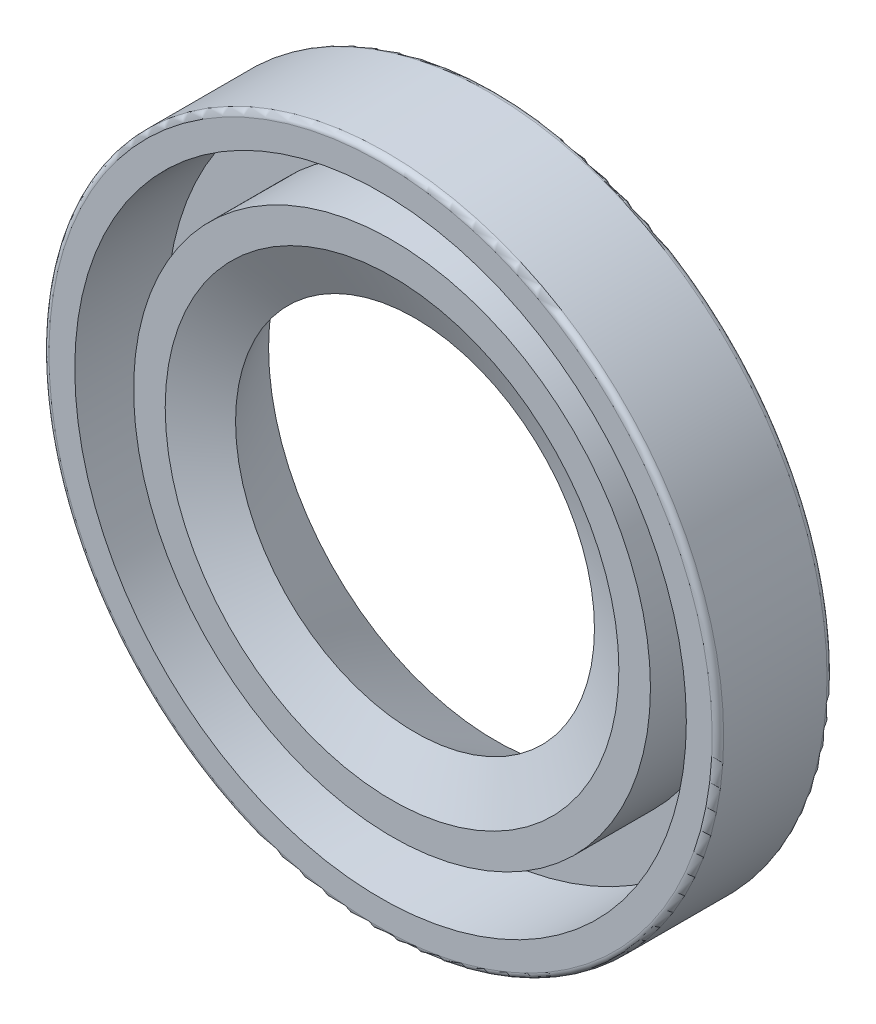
ISO-10303-21;
HEADER;
FILE_DESCRIPTION(('STEP AP214'),'2;1');
FILE_NAME('part.step','',(''),(''),'','','');
FILE_SCHEMA(('AUTOMOTIVE_DESIGN { 1 0 10303 214 1 1 1 1 }'));
ENDSEC;
DATA;
#1=APPLICATION_CONTEXT('core data for automotive mechanical design processes');
#2=APPLICATION_PROTOCOL_DEFINITION('international standard','automotive_design',2000,#1);
#3=PRODUCT_CONTEXT('',#1,'mechanical');
#4=PRODUCT('Part','Part','',(#3));
#5=PRODUCT_RELATED_PRODUCT_CATEGORY('part','',(#4));
#6=PRODUCT_DEFINITION_FORMATION('','',#4);
#7=PRODUCT_DEFINITION_CONTEXT('part definition',#1,'design');
#8=PRODUCT_DEFINITION('design','',#6,#7);
#9=PRODUCT_DEFINITION_SHAPE('','',#8);
#10=(LENGTH_UNIT() NAMED_UNIT(*) SI_UNIT(.MILLI.,.METRE.));
#11=(NAMED_UNIT(*) PLANE_ANGLE_UNIT() SI_UNIT($,.RADIAN.));
#12=(NAMED_UNIT(*) SI_UNIT($,.STERADIAN.) SOLID_ANGLE_UNIT());
#13=UNCERTAINTY_MEASURE_WITH_UNIT(LENGTH_MEASURE(1.E-05),#10,'distance_accuracy_value','');
#14=(GEOMETRIC_REPRESENTATION_CONTEXT(3) GLOBAL_UNCERTAINTY_ASSIGNED_CONTEXT((#13)) GLOBAL_UNIT_ASSIGNED_CONTEXT((#10,
#11,#12)) REPRESENTATION_CONTEXT('',''));
#15=CARTESIAN_POINT('',(0.,0.,0.));
#16=DIRECTION('',(0.,0.,1.));
#17=DIRECTION('',(1.,0.,0.));
#18=AXIS2_PLACEMENT_3D('',#15,#16,#17);
#19=CARTESIAN_POINT('',(0.,15.8,-58.8));
#20=DIRECTION('',(0.,0.,-1.));
#21=DIRECTION('',(-1.,0.,0.));
#22=AXIS2_PLACEMENT_3D('',#19,#20,#21);
#23=PLANE('',#22);
#24=CARTESIAN_POINT('',(0.,0.,-58.8));
#25=DIRECTION('',(0.,0.,1.));
#26=DIRECTION('',(1.,0.,0.));
#27=AXIS2_PLACEMENT_3D('',#24,#25,#26);
#28=CIRCLE('',#27,15.8);
#29=CARTESIAN_POINT('',(15.8,0.,-58.8));
#30=VERTEX_POINT('',#29);
#31=EDGE_CURVE('E140',#30,#30,#28,.F.);
#32=ORIENTED_EDGE('',*,*,#31,.T.);
#33=EDGE_LOOP('',(#32));
#34=FACE_BOUND('',#33,.T.);
#35=CARTESIAN_POINT('',(0.,0.,-58.8));
#36=DIRECTION('',(0.,0.,1.));
#37=DIRECTION('',(1.,0.,0.));
#38=AXIS2_PLACEMENT_3D('',#35,#36,#37);
#39=CIRCLE('',#38,18.);
#40=CARTESIAN_POINT('',(18.,0.,-58.8));
#41=VERTEX_POINT('',#40);
#42=EDGE_CURVE('E17',#41,#41,#39,.F.);
#43=ORIENTED_EDGE('',*,*,#42,.F.);
#44=EDGE_LOOP('',(#43));
#45=FACE_BOUND('',#44,.T.);
#46=ADVANCED_FACE('F13',(#34,#45),#23,.F.);
#47=CARTESIAN_POINT('',(0.,0.,-66.));
#48=DIRECTION('',(0.,0.,1.));
#49=DIRECTION('',(1.,0.,0.));
#50=AXIS2_PLACEMENT_3D('',#47,#48,#49);
#51=CYLINDRICAL_SURFACE('',#50,18.);
#52=ORIENTED_EDGE('',*,*,#42,.T.);
#53=EDGE_LOOP('',(#52));
#54=FACE_BOUND('',#53,.T.);
#55=CARTESIAN_POINT('',(0.,0.,-64.4));
#56=DIRECTION('',(0.,0.,1.));
#57=DIRECTION('',(1.,0.,0.));
#58=AXIS2_PLACEMENT_3D('',#55,#56,#57);
#59=CIRCLE('',#58,18.);
#60=CARTESIAN_POINT('',(18.,0.,-64.4));
#61=VERTEX_POINT('',#60);
#62=EDGE_CURVE('E138',#61,#61,#59,.T.);
#63=ORIENTED_EDGE('',*,*,#62,.T.);
#64=EDGE_LOOP('',(#63));
#65=FACE_BOUND('',#64,.T.);
#66=ADVANCED_FACE('F104',(#54,#65),#51,.T.);
#67=CARTESIAN_POINT('',(0.,0.,-58.8));
#68=DIRECTION('',(0.,0.,1.));
#69=DIRECTION('',(1.,0.,0.));
#70=AXIS2_PLACEMENT_3D('',#67,#68,#69);
#71=CONICAL_SURFACE('',#70,15.8,1.11934323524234);
#72=CARTESIAN_POINT('',(0.,0.,-60.4));
#73=DIRECTION('',(0.,0.,-1.));
#74=DIRECTION('',(0.,1.,0.));
#75=AXIS2_PLACEMENT_3D('',#72,#73,#74);
#76=CIRCLE('',#75,12.5);
#77=CARTESIAN_POINT('',(0.,12.5,-60.4));
#78=VERTEX_POINT('',#77);
#79=EDGE_CURVE('E137',#78,#78,#76,.T.);
#80=ORIENTED_EDGE('',*,*,#79,.T.);
#81=EDGE_LOOP('',(#80));
#82=FACE_BOUND('',#81,.T.);
#83=ORIENTED_EDGE('',*,*,#31,.F.);
#84=EDGE_LOOP('',(#83));
#85=FACE_BOUND('',#84,.T.);
#86=ADVANCED_FACE('F100',(#82,#85),#71,.F.);
#87=CARTESIAN_POINT('',(0.,18.,-64.4));
#88=DIRECTION('',(0.,0.,-1.));
#89=DIRECTION('',(-1.,0.,0.));
#90=AXIS2_PLACEMENT_3D('',#87,#88,#89);
#91=PLANE('',#90);
#92=ORIENTED_EDGE('',*,*,#62,.F.);
#93=EDGE_LOOP('',(#92));
#94=FACE_BOUND('',#93,.T.);
#95=CARTESIAN_POINT('',(0.,0.,-64.4));
#96=DIRECTION('',(0.,0.,1.));
#97=DIRECTION('',(1.,0.,0.));
#98=AXIS2_PLACEMENT_3D('',#95,#96,#97);
#99=CIRCLE('',#98,21.3);
#100=CARTESIAN_POINT('',(21.3,0.,-64.4));
#101=VERTEX_POINT('',#100);
#102=EDGE_CURVE('E130',#101,#101,#99,.T.);
#103=ORIENTED_EDGE('',*,*,#102,.T.);
#104=EDGE_LOOP('',(#103));
#105=FACE_BOUND('',#104,.T.);
#106=ADVANCED_FACE('F96',(#94,#105),#91,.F.);
#107=CARTESIAN_POINT('',(0.,0.,-66.));
#108=DIRECTION('',(0.,0.,-1.));
#109=DIRECTION('',(-1.,0.,0.));
#110=AXIS2_PLACEMENT_3D('',#107,#108,#109);
#111=CONICAL_SURFACE('',#110,15.8,0.532504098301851);
#112=CARTESIAN_POINT('',(0.,0.,-66.));
#113=DIRECTION('',(0.,0.,-1.));
#114=DIRECTION('',(-1.,0.,0.));
#115=AXIS2_PLACEMENT_3D('',#112,#113,#114);
#116=CIRCLE('',#115,15.8);
#117=CARTESIAN_POINT('',(-15.8,0.,-66.));
#118=VERTEX_POINT('',#117);
#119=EDGE_CURVE('E125',#118,#118,#116,.T.);
#120=ORIENTED_EDGE('',*,*,#119,.T.);
#121=EDGE_LOOP('',(#120));
#122=FACE_BOUND('',#121,.T.);
#123=ORIENTED_EDGE('',*,*,#79,.F.);
#124=EDGE_LOOP('',(#123));
#125=FACE_BOUND('',#124,.T.);
#126=ADVANCED_FACE('F92',(#122,#125),#111,.F.);
#127=CARTESIAN_POINT('',(0.,0.,-66.));
#128=DIRECTION('',(0.,0.,1.));
#129=DIRECTION('',(1.,0.,0.));
#130=AXIS2_PLACEMENT_3D('',#127,#128,#129);
#131=CYLINDRICAL_SURFACE('',#130,21.3);
#132=ORIENTED_EDGE('',*,*,#102,.F.);
#133=EDGE_LOOP('',(#132));
#134=FACE_BOUND('',#133,.T.);
#135=CARTESIAN_POINT('',(0.,0.,-58.));
#136=DIRECTION('',(0.,0.,1.));
#137=DIRECTION('',(1.,0.,0.));
#138=AXIS2_PLACEMENT_3D('',#135,#136,#137);
#139=CIRCLE('',#138,21.3);
#140=CARTESIAN_POINT('',(21.3,0.,-58.));
#141=VERTEX_POINT('',#140);
#142=EDGE_CURVE('E123',#141,#141,#139,.T.);
#143=ORIENTED_EDGE('',*,*,#142,.T.);
#144=EDGE_LOOP('',(#143));
#145=FACE_BOUND('',#144,.T.);
#146=ADVANCED_FACE('F88',(#134,#145),#131,.F.);
#147=CARTESIAN_POINT('',(0.,23.1,-66.));
#148=DIRECTION('',(0.,0.,1.));
#149=DIRECTION('',(1.,0.,0.));
#150=AXIS2_PLACEMENT_3D('',#147,#148,#149);
#151=PLANE('',#150);
#152=CARTESIAN_POINT('',(0.,0.,-66.));
#153=DIRECTION('',(0.,0.,1.));
#154=DIRECTION('',(0.,1.,0.));
#155=AXIS2_PLACEMENT_3D('',#152,#153,#154);
#156=CIRCLE('',#155,23.1);
#157=CARTESIAN_POINT('',(0.,23.1,-66.));
#158=VERTEX_POINT('',#157);
#159=EDGE_CURVE('E122',#158,#158,#156,.T.);
#160=ORIENTED_EDGE('',*,*,#159,.F.);
#161=EDGE_LOOP('',(#160));
#162=FACE_BOUND('',#161,.T.);
#163=ORIENTED_EDGE('',*,*,#119,.F.);
#164=EDGE_LOOP('',(#163));
#165=FACE_BOUND('',#164,.T.);
#166=ADVANCED_FACE('F79',(#162,#165),#151,.F.);
#167=CARTESIAN_POINT('',(0.,21.3,-58.));
#168=DIRECTION('',(0.,0.,-1.));
#169=DIRECTION('',(-1.,0.,0.));
#170=AXIS2_PLACEMENT_3D('',#167,#168,#169);
#171=PLANE('',#170);
#172=ORIENTED_EDGE('',*,*,#142,.F.);
#173=EDGE_LOOP('',(#172));
#174=FACE_BOUND('',#173,.T.);
#175=CARTESIAN_POINT('',(0.,0.,-58.));
#176=DIRECTION('',(0.,0.,-1.));
#177=DIRECTION('',(0.,1.,0.));
#178=AXIS2_PLACEMENT_3D('',#175,#176,#177);
#179=CIRCLE('',#178,23.1);
#180=CARTESIAN_POINT('',(0.,23.1,-58.));
#181=VERTEX_POINT('',#180);
#182=EDGE_CURVE('E26',#181,#181,#179,.T.);
#183=ORIENTED_EDGE('',*,*,#182,.F.);
#184=EDGE_LOOP('',(#183));
#185=FACE_BOUND('',#184,.T.);
#186=ADVANCED_FACE('F58',(#174,#185),#171,.F.);
#187=CARTESIAN_POINT('',(0.,0.,-65.6));
#188=DIRECTION('',(0.,0.,-1.));
#189=DIRECTION('',(0.,1.,0.));
#190=AXIS2_PLACEMENT_3D('',#187,#188,#189);
#191=TOROIDAL_SURFACE('',#190,23.1,0.4);
#192=CARTESIAN_POINT('',(0.,0.,-65.6));
#193=DIRECTION('',(0.,0.,1.));
#194=DIRECTION('',(1.,0.,0.));
#195=AXIS2_PLACEMENT_3D('',#192,#193,#194);
#196=CIRCLE('',#195,23.5);
#197=CARTESIAN_POINT('',(23.5,0.,-65.6));
#198=VERTEX_POINT('',#197);
#199=EDGE_CURVE('E21',#198,#198,#196,.T.);
#200=ORIENTED_EDGE('',*,*,#199,.F.);
#201=EDGE_LOOP('',(#200));
#202=FACE_BOUND('',#201,.T.);
#203=ORIENTED_EDGE('',*,*,#159,.T.);
#204=EDGE_LOOP('',(#203));
#205=FACE_BOUND('',#204,.T.);
#206=ADVANCED_FACE('F54',(#202,#205),#191,.T.);
#207=CARTESIAN_POINT('',(0.,0.,-58.4));
#208=DIRECTION('',(0.,0.,-1.));
#209=DIRECTION('',(0.,1.,0.));
#210=AXIS2_PLACEMENT_3D('',#207,#208,#209);
#211=TOROIDAL_SURFACE('',#210,23.1,0.4);
#212=ORIENTED_EDGE('',*,*,#182,.T.);
#213=EDGE_LOOP('',(#212));
#214=FACE_BOUND('',#213,.T.);
#215=CARTESIAN_POINT('',(0.,0.,-58.4));
#216=DIRECTION('',(0.,0.,1.));
#217=DIRECTION('',(1.,0.,0.));
#218=AXIS2_PLACEMENT_3D('',#215,#216,#217);
#219=CIRCLE('',#218,23.5);
#220=CARTESIAN_POINT('',(23.5,0.,-58.4));
#221=VERTEX_POINT('',#220);
#222=EDGE_CURVE('E9',#221,#221,#219,.F.);
#223=ORIENTED_EDGE('',*,*,#222,.F.);
#224=EDGE_LOOP('',(#223));
#225=FACE_BOUND('',#224,.T.);
#226=ADVANCED_FACE('F45',(#214,#225),#211,.T.);
#227=CARTESIAN_POINT('',(0.,0.,-66.));
#228=DIRECTION('',(0.,0.,1.));
#229=DIRECTION('',(1.,0.,0.));
#230=AXIS2_PLACEMENT_3D('',#227,#228,#229);
#231=CYLINDRICAL_SURFACE('',#230,23.5);
#232=ORIENTED_EDGE('',*,*,#222,.T.);
#233=EDGE_LOOP('',(#232));
#234=FACE_BOUND('',#233,.T.);
#235=ORIENTED_EDGE('',*,*,#199,.T.);
#236=EDGE_LOOP('',(#235));
#237=FACE_BOUND('',#236,.T.);
#238=ADVANCED_FACE('F15',(#234,#237),#231,.T.);
#239=CLOSED_SHELL('',(#46,#66,#86,#106,#126,#146,#166,#186,#206,#226,#238));
#240=MANIFOLD_SOLID_BREP('B1',#239);
#241=ADVANCED_BREP_SHAPE_REPRESENTATION('',(#18,#240),#14);
#242=SHAPE_DEFINITION_REPRESENTATION(#9,#241);
ENDSEC;
END-ISO-10303-21;
